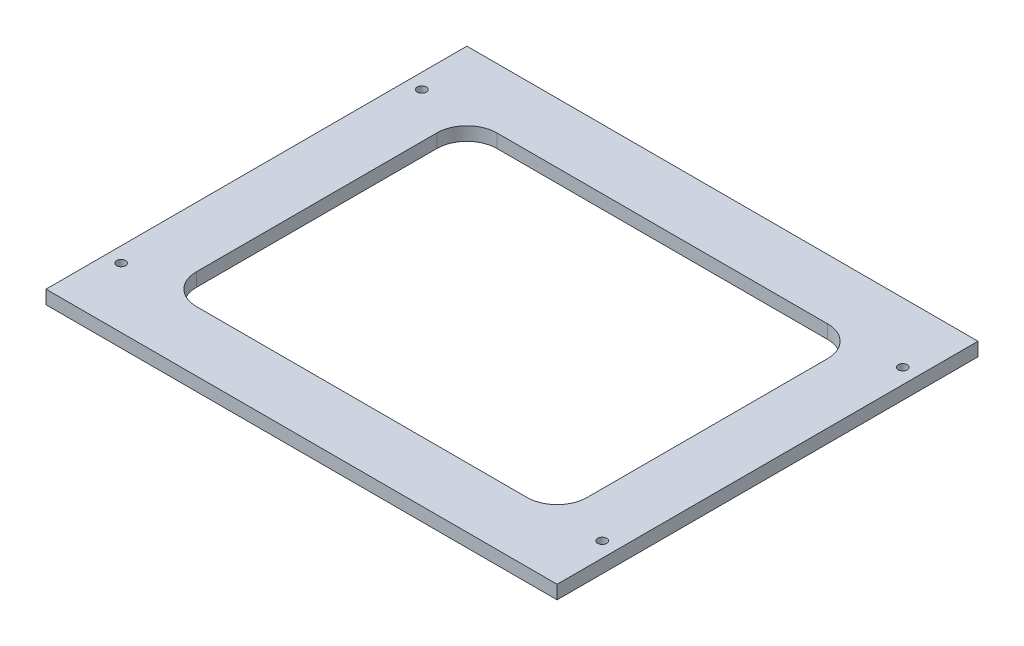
from build123d import *

# Parameters (mm, degrees)
SKETCH1_W           = 170
SKETCH1_H           = 140
BOSS_EXTRUDE1_DEPTH = 4.5
CUT_EXTRUDE1_REACH  = 151.843
SKETCH2_R           = 1.5


with BuildPart() as part:
    # Sketch1 → Boss-Extrude1 (new body)
    with BuildSketch(Plane(origin=(0, 4.5, 0), x_dir=(1, 0, 0), z_dir=(0, 1, 0))):
        with Locations((-46.363636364, 1.947174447)):
            Rectangle(SKETCH1_W, SKETCH1_H)
        with BuildLine():
            Line((8.636363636, -48.052825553), (-101.363636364, -48.052825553))
            ThreePointArc((-101.363636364, -48.052825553), (-108.434704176, -45.123893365), (-111.363636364, -38.052825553))
            Line((-111.363636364, -38.052825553), (-111.363636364, 41.947174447))
            ThreePointArc((-111.363636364, 41.947174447), (-108.434704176, 49.018242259), (-101.363636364, 51.947174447))
            Line((-101.363636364, 51.947174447), (8.636363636, 51.947174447))
            ThreePointArc((8.636363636, 51.947174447), (15.707431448, 49.018242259), (18.636363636, 41.947174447))
            Line((18.636363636, 41.947174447), (18.636363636, -38.052825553))
            ThreePointArc((18.636363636, -38.052825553), (15.707431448, -45.123893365), (8.636363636, -48.052825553))
        make_face(mode=Mode.SUBTRACT)
    extrude(amount=-BOSS_EXTRUDE1_DEPTH)

    # Sketch2 → Cut-Extrude1 (cut, up to next)
    with BuildSketch(Plane(origin=(0, 4.5, 0), x_dir=(1, 0, 0), z_dir=(0, 1, 0)), mode=Mode.PRIVATE) as cut_extrude1_sk1:
        with Locations(Location((-126.363636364, 51.947174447, 0), (0, 0, 270))):
            Circle(SKETCH2_R)
    cut_extrude1_tool1 = extrude(cut_extrude1_sk1.sketch, amount=-CUT_EXTRUDE1_REACH, mode=Mode.PRIVATE) & part.part
    # Sketch2 → Cut-Extrude1 (cut, up to next)
    with BuildSketch(Plane(origin=(0, 4.5, 0), x_dir=(1, 0, 0), z_dir=(0, 1, 0)), mode=Mode.PRIVATE) as cut_extrude1_sk2:
        with Locations(Location((33.636363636, 51.947174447, 0), (0, 0, 270))):
            Circle(SKETCH2_R)
    cut_extrude1_tool2 = extrude(cut_extrude1_sk2.sketch, amount=-CUT_EXTRUDE1_REACH, mode=Mode.PRIVATE) & part.part
    # Sketch2 → Cut-Extrude1 (cut, up to next)
    with BuildSketch(Plane(origin=(0, 4.5, 0), x_dir=(1, 0, 0), z_dir=(0, 1, 0)), mode=Mode.PRIVATE) as cut_extrude1_sk3:
        with Locations(Location((33.636363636, -48.052825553, 0), (0, 0, 270))):
            Circle(SKETCH2_R)
    cut_extrude1_tool3 = extrude(cut_extrude1_sk3.sketch, amount=-CUT_EXTRUDE1_REACH, mode=Mode.PRIVATE) & part.part
    # Sketch2 → Cut-Extrude1 (cut, up to next)
    with BuildSketch(Plane(origin=(0, 4.5, 0), x_dir=(1, 0, 0), z_dir=(0, 1, 0)), mode=Mode.PRIVATE) as cut_extrude1_sk4:
        with Locations(Location((-126.363636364, -48.052825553, 0), (0, 0, 270))):
            Circle(SKETCH2_R)
    cut_extrude1_tool4 = extrude(cut_extrude1_sk4.sketch, amount=-CUT_EXTRUDE1_REACH, mode=Mode.PRIVATE) & part.part
    add(cut_extrude1_tool1.solids().sort_by_distance((-126.363636, 4.5, -51.947174))[0], mode=Mode.SUBTRACT)
    add(cut_extrude1_tool2.solids().sort_by_distance((33.636364, 4.5, -51.947174))[0], mode=Mode.SUBTRACT)
    add(cut_extrude1_tool3.solids().sort_by_distance((33.636364, 4.5, 48.052826))[0], mode=Mode.SUBTRACT)
    add(cut_extrude1_tool4.solids().sort_by_distance((-126.363636, 4.5, 48.052826))[0], mode=Mode.SUBTRACT)


solid = part.part
